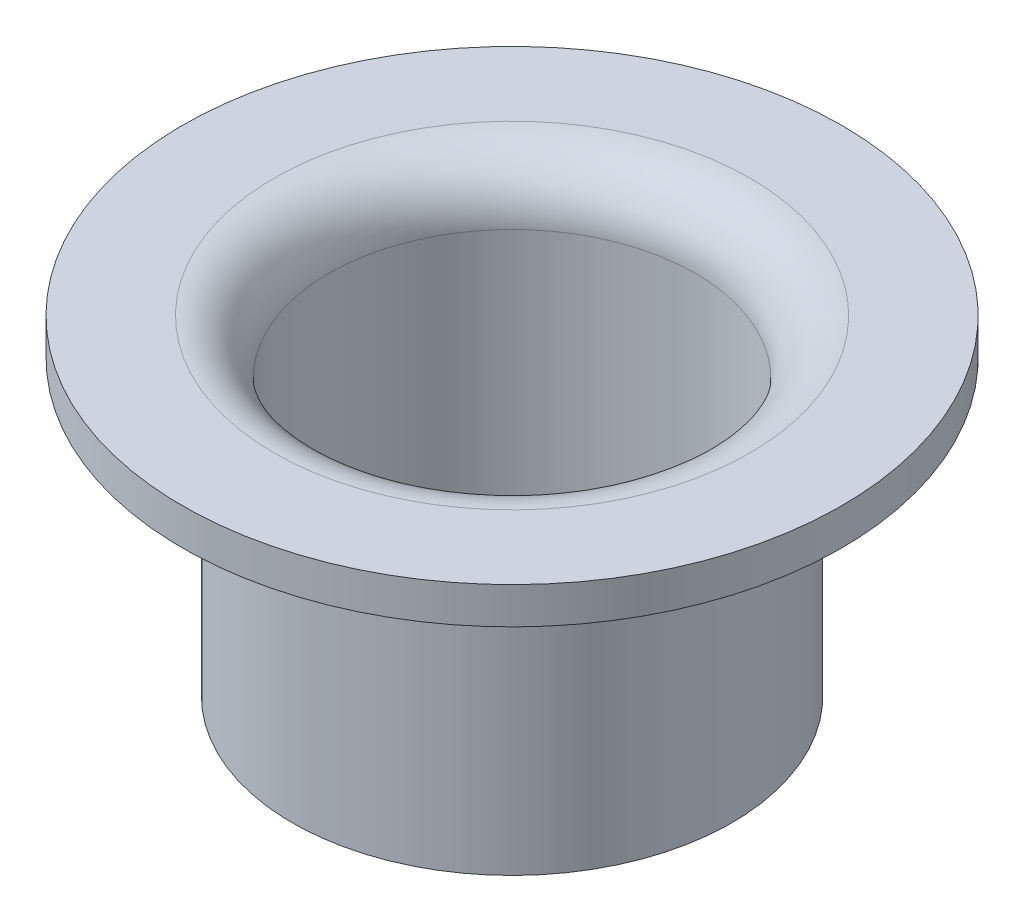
ISO-10303-21;
HEADER;
FILE_DESCRIPTION(('STEP AP214'),'2;1');
FILE_NAME('part.step','',(''),(''),'','','');
FILE_SCHEMA(('AUTOMOTIVE_DESIGN { 1 0 10303 214 1 1 1 1 }'));
ENDSEC;
DATA;
#1=APPLICATION_CONTEXT('core data for automotive mechanical design processes');
#2=APPLICATION_PROTOCOL_DEFINITION('international standard','automotive_design',2000,#1);
#3=PRODUCT_CONTEXT('',#1,'mechanical');
#4=PRODUCT('Part','Part','',(#3));
#5=PRODUCT_RELATED_PRODUCT_CATEGORY('part','',(#4));
#6=PRODUCT_DEFINITION_FORMATION('','',#4);
#7=PRODUCT_DEFINITION_CONTEXT('part definition',#1,'design');
#8=PRODUCT_DEFINITION('design','',#6,#7);
#9=PRODUCT_DEFINITION_SHAPE('','',#8);
#10=(LENGTH_UNIT() NAMED_UNIT(*) SI_UNIT(.MILLI.,.METRE.));
#11=(NAMED_UNIT(*) PLANE_ANGLE_UNIT() SI_UNIT($,.RADIAN.));
#12=(NAMED_UNIT(*) SI_UNIT($,.STERADIAN.) SOLID_ANGLE_UNIT());
#13=UNCERTAINTY_MEASURE_WITH_UNIT(LENGTH_MEASURE(1.E-05),#10,'distance_accuracy_value','');
#14=(GEOMETRIC_REPRESENTATION_CONTEXT(3) GLOBAL_UNCERTAINTY_ASSIGNED_CONTEXT((#13)) GLOBAL_UNIT_ASSIGNED_CONTEXT((#10,
#11,#12)) REPRESENTATION_CONTEXT('',''));
#15=CARTESIAN_POINT('',(0.,0.,0.));
#16=DIRECTION('',(0.,0.,1.));
#17=DIRECTION('',(1.,0.,0.));
#18=AXIS2_PLACEMENT_3D('',#15,#16,#17);
#19=CARTESIAN_POINT('',(0.,0.,0.));
#20=DIRECTION('',(0.,-1.00000000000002,0.));
#21=DIRECTION('',(0.,0.,-1.00000000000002));
#22=AXIS2_PLACEMENT_3D('',#19,#20,#21);
#23=CYLINDRICAL_SURFACE('',#22,6.);
#24=CARTESIAN_POINT('',(0.,38.1455186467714,0.));
#25=DIRECTION('',(0.,-1.00000000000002,0.));
#26=DIRECTION('',(0.,0.,-1.00000000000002));
#27=AXIS2_PLACEMENT_3D('',#24,#25,#26);
#28=CIRCLE('',#27,5.99999999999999);
#29=CARTESIAN_POINT('',(1.89737114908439E-13,38.1455186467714,-6.));
#30=VERTEX_POINT('',#29);
#31=EDGE_CURVE('E52',#30,#30,#28,.T.);
#32=ORIENTED_EDGE('',*,*,#31,.T.);
#33=EDGE_LOOP('',(#32));
#34=FACE_BOUND('',#33,.T.);
#35=CARTESIAN_POINT('',(0.,30.6455186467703,0.));
#36=DIRECTION('',(0.,-1.00000000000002,0.));
#37=DIRECTION('',(0.,0.,-1.00000000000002));
#38=AXIS2_PLACEMENT_3D('',#35,#36,#37);
#39=CIRCLE('',#38,6.);
#40=CARTESIAN_POINT('',(1.6198153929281E-13,30.6455186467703,-6.00000000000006));
#41=VERTEX_POINT('',#40);
#42=EDGE_CURVE('E10',#41,#41,#39,.T.);
#43=ORIENTED_EDGE('',*,*,#42,.F.);
#44=EDGE_LOOP('',(#43));
#45=FACE_BOUND('',#44,.T.);
#46=ADVANCED_FACE('F24',(#34,#45),#23,.T.);
#47=CARTESIAN_POINT('',(6.00000000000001,30.6455186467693,0.));
#48=DIRECTION('',(0.,-1.00000000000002,0.));
#49=DIRECTION('',(0.,0.,-1.00000000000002));
#50=AXIS2_PLACEMENT_3D('',#47,#48,#49);
#51=PLANE('',#50);
#52=ORIENTED_EDGE('',*,*,#42,.T.);
#53=EDGE_LOOP('',(#52));
#54=FACE_BOUND('',#53,.T.);
#55=CARTESIAN_POINT('',(0.,30.6455186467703,0.));
#56=DIRECTION('',(0.,-1.00000000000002,0.));
#57=DIRECTION('',(0.,0.,-1.00000000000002));
#58=AXIS2_PLACEMENT_3D('',#55,#56,#57);
#59=CIRCLE('',#58,5.);
#60=CARTESIAN_POINT('',(1.39610545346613E-13,30.6455186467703,-5.00000000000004));
#61=VERTEX_POINT('',#60);
#62=EDGE_CURVE('E30',#61,#61,#59,.T.);
#63=ORIENTED_EDGE('',*,*,#62,.F.);
#64=EDGE_LOOP('',(#63));
#65=FACE_BOUND('',#64,.T.);
#66=ADVANCED_FACE('F70',(#54,#65),#51,.T.);
#67=CARTESIAN_POINT('',(0.,0.,0.));
#68=DIRECTION('',(0.,-1.00000000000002,0.));
#69=DIRECTION('',(0.,0.,-1.00000000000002));
#70=AXIS2_PLACEMENT_3D('',#67,#68,#69);
#71=CYLINDRICAL_SURFACE('',#70,5.);
#72=ORIENTED_EDGE('',*,*,#62,.T.);
#73=EDGE_LOOP('',(#72));
#74=FACE_BOUND('',#73,.T.);
#75=CARTESIAN_POINT('',(0.,38.1455186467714,0.));
#76=DIRECTION('',(0.,-1.00000000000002,0.));
#77=DIRECTION('',(0.,0.,-1.00000000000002));
#78=AXIS2_PLACEMENT_3D('',#75,#76,#77);
#79=CIRCLE('',#78,5.);
#80=CARTESIAN_POINT('',(1.67366120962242E-13,38.1455186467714,-4.99999999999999));
#81=VERTEX_POINT('',#80);
#82=EDGE_CURVE('E34',#81,#81,#79,.T.);
#83=ORIENTED_EDGE('',*,*,#82,.F.);
#84=EDGE_LOOP('',(#83));
#85=FACE_BOUND('',#84,.T.);
#86=ADVANCED_FACE('F74',(#74,#85),#71,.F.);
#87=CARTESIAN_POINT('',(0.,38.1455186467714,0.));
#88=DIRECTION('',(0.,-1.00000000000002,0.));
#89=DIRECTION('',(0.,0.,-1.00000000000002));
#90=AXIS2_PLACEMENT_3D('',#87,#88,#89);
#91=TOROIDAL_SURFACE('',#90,6.5,1.5);
#92=ORIENTED_EDGE('',*,*,#82,.T.);
#93=EDGE_LOOP('',(#92));
#94=FACE_BOUND('',#93,.T.);
#95=CARTESIAN_POINT('',(0.,39.6455186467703,0.));
#96=DIRECTION('',(0.,-1.00000000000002,0.));
#97=DIRECTION('',(0.,0.,-1.00000000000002));
#98=AXIS2_PLACEMENT_3D('',#95,#96,#97);
#99=CIRCLE('',#98,6.5);
#100=CARTESIAN_POINT('',(1.4541146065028E-13,39.6455186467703,-6.50000000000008));
#101=VERTEX_POINT('',#100);
#102=EDGE_CURVE('E38',#101,#101,#99,.T.);
#103=ORIENTED_EDGE('',*,*,#102,.F.);
#104=EDGE_LOOP('',(#103));
#105=FACE_BOUND('',#104,.T.);
#106=ADVANCED_FACE('F78',(#94,#105),#91,.T.);
#107=CARTESIAN_POINT('',(6.5000000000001,39.6455186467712,-1.2490009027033E-13));
#108=DIRECTION('',(0.,1.00000000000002,0.));
#109=DIRECTION('',(0.,0.,1.00000000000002));
#110=AXIS2_PLACEMENT_3D('',#107,#108,#109);
#111=PLANE('',#110);
#112=ORIENTED_EDGE('',*,*,#102,.T.);
#113=EDGE_LOOP('',(#112));
#114=FACE_BOUND('',#113,.T.);
#115=CARTESIAN_POINT('',(0.,39.6455186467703,0.));
#116=DIRECTION('',(0.,-1.00000000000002,0.));
#117=DIRECTION('',(0.,0.,-1.00000000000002));
#118=AXIS2_PLACEMENT_3D('',#115,#116,#117);
#119=CIRCLE('',#118,8.99999999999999);
#120=CARTESIAN_POINT('',(2.01338945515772E-13,39.6455186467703,-9.00000000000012));
#121=VERTEX_POINT('',#120);
#122=EDGE_CURVE('E43',#121,#121,#119,.T.);
#123=ORIENTED_EDGE('',*,*,#122,.F.);
#124=EDGE_LOOP('',(#123));
#125=FACE_BOUND('',#124,.T.);
#126=ADVANCED_FACE('F84',(#114,#125),#111,.T.);
#127=CARTESIAN_POINT('',(0.,0.,0.));
#128=DIRECTION('',(0.,-1.00000000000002,0.));
#129=DIRECTION('',(0.,0.,-1.00000000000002));
#130=AXIS2_PLACEMENT_3D('',#127,#128,#129);
#131=CYLINDRICAL_SURFACE('',#130,8.99999999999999);
#132=ORIENTED_EDGE('',*,*,#122,.T.);
#133=EDGE_LOOP('',(#132));
#134=FACE_BOUND('',#133,.T.);
#135=CARTESIAN_POINT('',(0.,38.6455186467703,0.));
#136=DIRECTION('',(0.,-1.00000000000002,0.));
#137=DIRECTION('',(0.,0.,-1.00000000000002));
#138=AXIS2_PLACEMENT_3D('',#135,#136,#137);
#139=CIRCLE('',#138,8.99999999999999);
#140=CARTESIAN_POINT('',(2.15216733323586E-13,38.6455186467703,-9.00000000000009));
#141=VERTEX_POINT('',#140);
#142=EDGE_CURVE('E46',#141,#141,#139,.T.);
#143=ORIENTED_EDGE('',*,*,#142,.F.);
#144=EDGE_LOOP('',(#143));
#145=FACE_BOUND('',#144,.T.);
#146=ADVANCED_FACE('F66',(#134,#145),#131,.T.);
#147=CARTESIAN_POINT('',(9.00000000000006,38.6455186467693,0.));
#148=DIRECTION('',(0.,-1.00000000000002,0.));
#149=DIRECTION('',(0.,0.,-1.00000000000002));
#150=AXIS2_PLACEMENT_3D('',#147,#148,#149);
#151=PLANE('',#150);
#152=ORIENTED_EDGE('',*,*,#142,.T.);
#153=EDGE_LOOP('',(#152));
#154=FACE_BOUND('',#153,.T.);
#155=CARTESIAN_POINT('',(0.,38.6455186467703,0.));
#156=DIRECTION('',(0.,-1.00000000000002,0.));
#157=DIRECTION('',(0.,0.,-1.00000000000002));
#158=AXIS2_PLACEMENT_3D('',#155,#156,#157);
#159=CIRCLE('',#158,6.5);
#160=CARTESIAN_POINT('',(1.59289248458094E-13,38.6455186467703,-6.50000000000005));
#161=VERTEX_POINT('',#160);
#162=EDGE_CURVE('E49',#161,#161,#159,.T.);
#163=ORIENTED_EDGE('',*,*,#162,.F.);
#164=EDGE_LOOP('',(#163));
#165=FACE_BOUND('',#164,.T.);
#166=ADVANCED_FACE('F60',(#154,#165),#151,.T.);
#167=CARTESIAN_POINT('',(0.,38.1455186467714,0.));
#168=DIRECTION('',(0.,-1.00000000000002,0.));
#169=DIRECTION('',(0.,0.,-1.00000000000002));
#170=AXIS2_PLACEMENT_3D('',#167,#168,#169);
#171=TOROIDAL_SURFACE('',#170,6.5,0.500000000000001);
#172=ORIENTED_EDGE('',*,*,#162,.T.);
#173=EDGE_LOOP('',(#172));
#174=FACE_BOUND('',#173,.T.);
#175=ORIENTED_EDGE('',*,*,#31,.F.);
#176=EDGE_LOOP('',(#175));
#177=FACE_BOUND('',#176,.T.);
#178=ADVANCED_FACE('F58',(#174,#177),#171,.F.);
#179=CLOSED_SHELL('',(#46,#66,#86,#106,#126,#146,#166,#178));
#180=MANIFOLD_SOLID_BREP('B2',#179);
#181=ADVANCED_BREP_SHAPE_REPRESENTATION('',(#18,#180),#14);
#182=SHAPE_DEFINITION_REPRESENTATION(#9,#181);
ENDSEC;
END-ISO-10303-21;
